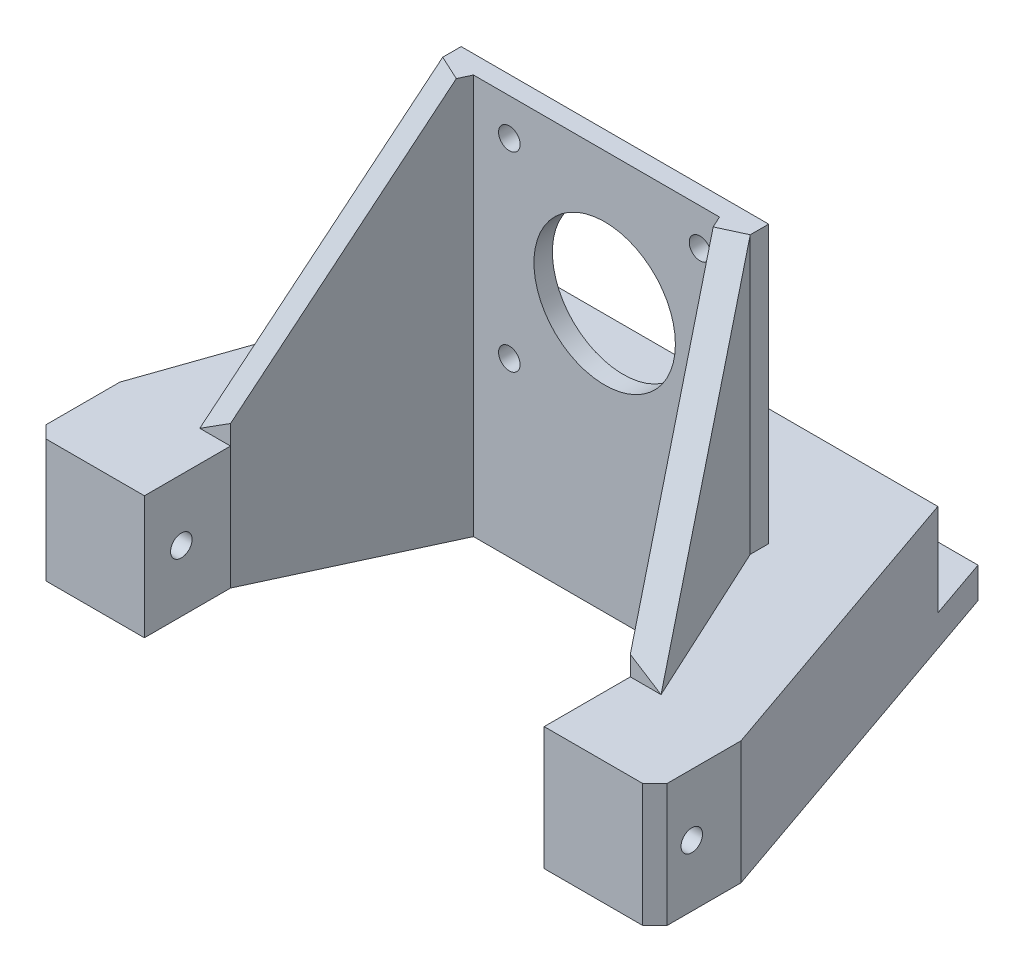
ISO-10303-21;
HEADER;
FILE_DESCRIPTION(('STEP AP214'),'2;1');
FILE_NAME('part.step','',(''),(''),'','','');
FILE_SCHEMA(('AUTOMOTIVE_DESIGN { 1 0 10303 214 1 1 1 1 }'));
ENDSEC;
DATA;
#1=APPLICATION_CONTEXT('core data for automotive mechanical design processes');
#2=APPLICATION_PROTOCOL_DEFINITION('international standard','automotive_design',2000,#1);
#3=PRODUCT_CONTEXT('',#1,'mechanical');
#4=PRODUCT('Part','Part','',(#3));
#5=PRODUCT_RELATED_PRODUCT_CATEGORY('part','',(#4));
#6=PRODUCT_DEFINITION_FORMATION('','',#4);
#7=PRODUCT_DEFINITION_CONTEXT('part definition',#1,'design');
#8=PRODUCT_DEFINITION('design','',#6,#7);
#9=PRODUCT_DEFINITION_SHAPE('','',#8);
#10=(LENGTH_UNIT() NAMED_UNIT(*) SI_UNIT(.MILLI.,.METRE.));
#11=(NAMED_UNIT(*) PLANE_ANGLE_UNIT() SI_UNIT($,.RADIAN.));
#12=(NAMED_UNIT(*) SI_UNIT($,.STERADIAN.) SOLID_ANGLE_UNIT());
#13=UNCERTAINTY_MEASURE_WITH_UNIT(LENGTH_MEASURE(1.E-05),#10,'distance_accuracy_value','');
#14=(GEOMETRIC_REPRESENTATION_CONTEXT(3) GLOBAL_UNCERTAINTY_ASSIGNED_CONTEXT((#13)) GLOBAL_UNIT_ASSIGNED_CONTEXT((#10,
#11,#12)) REPRESENTATION_CONTEXT('',''));
#15=CARTESIAN_POINT('',(0.,0.,0.));
#16=DIRECTION('',(0.,0.,1.));
#17=DIRECTION('',(1.,0.,0.));
#18=AXIS2_PLACEMENT_3D('',#15,#16,#17);
#19=CARTESIAN_POINT('',(0.,20.,-22.));
#20=DIRECTION('',(0.,0.,-1.));
#21=DIRECTION('',(-1.,0.,0.));
#22=AXIS2_PLACEMENT_3D('',#19,#20,#21);
#23=PLANE('',#22);
#24=DIRECTION('',(0.,-1.,0.));
#25=VECTOR('',#24,1.);
#26=CARTESIAN_POINT('',(33.5,20.,-22.));
#27=LINE('',#26,#25);
#28=CARTESIAN_POINT('',(33.5,20.,-22.));
#29=VERTEX_POINT('',#28);
#30=CARTESIAN_POINT('',(33.5,5.,-22.));
#31=VERTEX_POINT('',#30);
#32=EDGE_CURVE('E308',#29,#31,#27,.T.);
#33=ORIENTED_EDGE('',*,*,#32,.T.);
#34=DIRECTION('',(-1.,0.,0.));
#35=VECTOR('',#34,1.);
#36=CARTESIAN_POINT('',(33.5,5.,-22.));
#37=LINE('',#36,#35);
#38=CARTESIAN_POINT('',(-33.5,5.,-22.));
#39=VERTEX_POINT('',#38);
#40=EDGE_CURVE('E492',#31,#39,#37,.T.);
#41=ORIENTED_EDGE('',*,*,#40,.T.);
#42=DIRECTION('',(0.,-1.,0.));
#43=VECTOR('',#42,1.);
#44=CARTESIAN_POINT('',(-33.5,20.,-22.));
#45=LINE('',#44,#43);
#46=CARTESIAN_POINT('',(-33.5,20.,-22.));
#47=VERTEX_POINT('',#46);
#48=EDGE_CURVE('E283',#47,#39,#45,.T.);
#49=ORIENTED_EDGE('',*,*,#48,.F.);
#50=DIRECTION('',(1.,0.,0.));
#51=VECTOR('',#50,1.);
#52=CARTESIAN_POINT('',(0.,20.,-22.));
#53=LINE('',#52,#51);
#54=EDGE_CURVE('E298',#47,#29,#53,.T.);
#55=ORIENTED_EDGE('',*,*,#54,.T.);
#56=EDGE_LOOP('',(#33,#41,#49,#55));
#57=FACE_BOUND('',#56,.T.);
#58=ADVANCED_FACE('F37',(#57),#23,.T.);
#59=CARTESIAN_POINT('',(0.,20.,27.));
#60=DIRECTION('',(0.,0.,1.));
#61=DIRECTION('',(1.,0.,0.));
#62=AXIS2_PLACEMENT_3D('',#59,#60,#61);
#63=PLANE('',#62);
#64=DIRECTION('',(0.,-1.,0.));
#65=VECTOR('',#64,1.);
#66=CARTESIAN_POINT('',(32.5,20.,27.));
#67=LINE('',#66,#65);
#68=CARTESIAN_POINT('',(32.5,23.1770686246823,27.));
#69=VERTEX_POINT('',#68);
#70=CARTESIAN_POINT('',(32.5,20.,27.));
#71=VERTEX_POINT('',#70);
#72=EDGE_CURVE('E331',#69,#71,#67,.T.);
#73=ORIENTED_EDGE('',*,*,#72,.T.);
#74=DIRECTION('',(-1.,0.,0.));
#75=VECTOR('',#74,1.);
#76=CARTESIAN_POINT('',(50.5,20.,27.));
#77=LINE('',#76,#75);
#78=CARTESIAN_POINT('',(37.5,20.,27.));
#79=VERTEX_POINT('',#78);
#80=EDGE_CURVE('E387',#79,#71,#77,.T.);
#81=ORIENTED_EDGE('',*,*,#80,.F.);
#82=DIRECTION('',(0.844024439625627,-0.536304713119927,0.));
#83=VECTOR('',#82,1.);
#84=CARTESIAN_POINT('',(10.7858529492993,36.9745356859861,27.));
#85=LINE('',#84,#83);
#86=EDGE_CURVE('E232',#69,#79,#85,.T.);
#87=ORIENTED_EDGE('',*,*,#86,.F.);
#88=EDGE_LOOP('',(#73,#81,#87));
#89=FACE_BOUND('',#88,.T.);
#90=ADVANCED_FACE('F468',(#89),#63,.T.);
#91=CARTESIAN_POINT('',(0.,20.,27.));
#92=DIRECTION('',(0.,0.,-1.));
#93=DIRECTION('',(-1.,0.,0.));
#94=AXIS2_PLACEMENT_3D('',#91,#92,#93);
#95=PLANE('',#94);
#96=DIRECTION('',(-1.,0.,0.));
#97=VECTOR('',#96,1.);
#98=CARTESIAN_POINT('',(-50.5,20.,27.));
#99=LINE('',#98,#97);
#100=CARTESIAN_POINT('',(-32.5,20.,27.));
#101=VERTEX_POINT('',#100);
#102=CARTESIAN_POINT('',(-37.5,20.,27.));
#103=VERTEX_POINT('',#102);
#104=EDGE_CURVE('E402',#101,#103,#99,.T.);
#105=ORIENTED_EDGE('',*,*,#104,.F.);
#106=DIRECTION('',(0.,-1.,0.));
#107=VECTOR('',#106,1.);
#108=CARTESIAN_POINT('',(-32.5,20.,27.));
#109=LINE('',#108,#107);
#110=CARTESIAN_POINT('',(-32.5,23.1770686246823,27.));
#111=VERTEX_POINT('',#110);
#112=EDGE_CURVE('E339',#111,#101,#109,.T.);
#113=ORIENTED_EDGE('',*,*,#112,.F.);
#114=DIRECTION('',(-0.844024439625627,-0.536304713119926,0.));
#115=VECTOR('',#114,1.);
#116=CARTESIAN_POINT('',(-10.7858529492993,36.9745356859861,27.));
#117=LINE('',#116,#115);
#118=EDGE_CURVE('E224',#111,#103,#117,.T.);
#119=ORIENTED_EDGE('',*,*,#118,.T.);
#120=EDGE_LOOP('',(#105,#113,#119));
#121=FACE_BOUND('',#120,.T.);
#122=ADVANCED_FACE('F428',(#121),#95,.F.);
#123=CARTESIAN_POINT('',(0.,20.,0.));
#124=DIRECTION('',(0.,0.,-1.));
#125=DIRECTION('',(-1.,0.,0.));
#126=AXIS2_PLACEMENT_3D('',#123,#124,#125);
#127=PLANE('',#126);
#128=CARTESIAN_POINT('',(1.33089386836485,43.5,0.));
#129=DIRECTION('',(0.,0.,1.));
#130=DIRECTION('',(1.,0.,0.));
#131=AXIS2_PLACEMENT_3D('',#128,#129,#130);
#132=CIRCLE('',#131,11.5);
#133=CARTESIAN_POINT('',(12.8308938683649,43.5,0.));
#134=VERTEX_POINT('',#133);
#135=EDGE_CURVE('E246',#134,#134,#132,.T.);
#136=ORIENTED_EDGE('',*,*,#135,.F.);
#137=EDGE_LOOP('',(#136));
#138=FACE_BOUND('',#137,.T.);
#139=CARTESIAN_POINT('',(-14.1691061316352,28.,0.));
#140=DIRECTION('',(0.,0.,1.));
#141=DIRECTION('',(1.,0.,0.));
#142=AXIS2_PLACEMENT_3D('',#139,#140,#141);
#143=CIRCLE('',#142,1.75);
#144=CARTESIAN_POINT('',(-12.4191061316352,28.,0.));
#145=VERTEX_POINT('',#144);
#146=EDGE_CURVE('E255',#145,#145,#143,.T.);
#147=ORIENTED_EDGE('',*,*,#146,.F.);
#148=EDGE_LOOP('',(#147));
#149=FACE_BOUND('',#148,.T.);
#150=CARTESIAN_POINT('',(16.8308938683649,28.,0.));
#151=DIRECTION('',(0.,0.,1.));
#152=DIRECTION('',(1.,0.,0.));
#153=AXIS2_PLACEMENT_3D('',#150,#151,#152);
#154=CIRCLE('',#153,1.75);
#155=CARTESIAN_POINT('',(18.5808938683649,28.,0.));
#156=VERTEX_POINT('',#155);
#157=EDGE_CURVE('E252',#156,#156,#154,.T.);
#158=ORIENTED_EDGE('',*,*,#157,.F.);
#159=EDGE_LOOP('',(#158));
#160=FACE_BOUND('',#159,.T.);
#161=CARTESIAN_POINT('',(16.8308938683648,59.,0.));
#162=DIRECTION('',(0.,0.,1.));
#163=DIRECTION('',(1.,0.,0.));
#164=AXIS2_PLACEMENT_3D('',#161,#162,#163);
#165=CIRCLE('',#164,1.75);
#166=CARTESIAN_POINT('',(18.5808938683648,59.,0.));
#167=VERTEX_POINT('',#166);
#168=EDGE_CURVE('E248',#167,#167,#165,.T.);
#169=ORIENTED_EDGE('',*,*,#168,.F.);
#170=EDGE_LOOP('',(#169));
#171=FACE_BOUND('',#170,.T.);
#172=CARTESIAN_POINT('',(-14.1691061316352,59.,0.));
#173=DIRECTION('',(0.,0.,1.));
#174=DIRECTION('',(1.,0.,0.));
#175=AXIS2_PLACEMENT_3D('',#172,#173,#174);
#176=CIRCLE('',#175,1.75);
#177=CARTESIAN_POINT('',(-12.4191061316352,59.,0.));
#178=VERTEX_POINT('',#177);
#179=EDGE_CURVE('E251',#178,#178,#176,.T.);
#180=ORIENTED_EDGE('',*,*,#179,.F.);
#181=EDGE_LOOP('',(#180));
#182=FACE_BOUND('',#181,.T.);
#183=DIRECTION('',(1.,0.,0.));
#184=VECTOR('',#183,1.);
#185=CARTESIAN_POINT('',(25.,65.,0.));
#186=LINE('',#185,#184);
#187=CARTESIAN_POINT('',(-20.,65.,0.));
#188=VERTEX_POINT('',#187);
#189=CARTESIAN_POINT('',(20.,65.,0.));
#190=VERTEX_POINT('',#189);
#191=EDGE_CURVE('E276',#188,#190,#186,.T.);
#192=ORIENTED_EDGE('',*,*,#191,.F.);
#193=DIRECTION('',(0.,-1.,0.));
#194=VECTOR('',#193,1.);
#195=CARTESIAN_POINT('',(-20.,20.,0.));
#196=LINE('',#195,#194);
#197=CARTESIAN_POINT('',(-20.,0.,0.));
#198=VERTEX_POINT('',#197);
#199=EDGE_CURVE('E336',#188,#198,#196,.T.);
#200=ORIENTED_EDGE('',*,*,#199,.T.);
#201=DIRECTION('',(1.,0.,0.));
#202=VECTOR('',#201,1.);
#203=CARTESIAN_POINT('',(0.,0.,0.));
#204=LINE('',#203,#202);
#205=CARTESIAN_POINT('',(20.,0.,0.));
#206=VERTEX_POINT('',#205);
#207=EDGE_CURVE('E312',#198,#206,#204,.T.);
#208=ORIENTED_EDGE('',*,*,#207,.T.);
#209=DIRECTION('',(0.,-1.,0.));
#210=VECTOR('',#209,1.);
#211=CARTESIAN_POINT('',(20.,20.,0.));
#212=LINE('',#211,#210);
#213=EDGE_CURVE('E334',#190,#206,#212,.T.);
#214=ORIENTED_EDGE('',*,*,#213,.F.);
#215=EDGE_LOOP('',(#192,#200,#208,#214));
#216=FACE_BOUND('',#215,.T.);
#217=ADVANCED_FACE('F474',(#138,#149,#160,#171,#182,#216),#127,.F.);
#218=CARTESIAN_POINT('',(0.,20.,0.));
#219=DIRECTION('',(0.,1.,0.));
#220=DIRECTION('',(0.,0.,1.));
#221=AXIS2_PLACEMENT_3D('',#218,#219,#220);
#222=PLANE('',#221);
#223=DIRECTION('',(-0.707106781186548,0.,-0.707106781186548));
#224=VECTOR('',#223,1.);
#225=CARTESIAN_POINT('',(-44.75,20.,44.75));
#226=LINE('',#225,#224);
#227=CARTESIAN_POINT('',(-48.5,20.,41.));
#228=VERTEX_POINT('',#227);
#229=CARTESIAN_POINT('',(-50.5,20.,39.));
#230=VERTEX_POINT('',#229);
#231=EDGE_CURVE('E191',#228,#230,#226,.T.);
#232=ORIENTED_EDGE('',*,*,#231,.F.);
#233=DIRECTION('',(-1.,0.,0.));
#234=VECTOR('',#233,1.);
#235=CARTESIAN_POINT('',(-50.5,20.,41.));
#236=LINE('',#235,#234);
#237=CARTESIAN_POINT('',(-32.5,20.,41.));
#238=VERTEX_POINT('',#237);
#239=EDGE_CURVE('E404',#238,#228,#236,.T.);
#240=ORIENTED_EDGE('',*,*,#239,.F.);
#241=DIRECTION('',(0.,0.,-1.));
#242=VECTOR('',#241,1.);
#243=CARTESIAN_POINT('',(-32.5,20.,41.));
#244=LINE('',#243,#242);
#245=EDGE_CURVE('E216',#238,#101,#244,.T.);
#246=ORIENTED_EDGE('',*,*,#245,.T.);
#247=ORIENTED_EDGE('',*,*,#104,.T.);
#248=DIRECTION('',(-0.420123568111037,0.,0.907466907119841));
#249=VECTOR('',#248,1.);
#250=CARTESIAN_POINT('',(-25.,20.,0.));
#251=LINE('',#250,#249);
#252=CARTESIAN_POINT('',(-25.,20.,0.));
#253=VERTEX_POINT('',#252);
#254=EDGE_CURVE('E237',#253,#103,#251,.T.);
#255=ORIENTED_EDGE('',*,*,#254,.F.);
#256=DIRECTION('',(0.,0.,1.));
#257=VECTOR('',#256,1.);
#258=CARTESIAN_POINT('',(-25.,20.,0.));
#259=LINE('',#258,#257);
#260=CARTESIAN_POINT('',(-25.,20.,-2.99999999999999));
#261=VERTEX_POINT('',#260);
#262=EDGE_CURVE('E282',#261,#253,#259,.T.);
#263=ORIENTED_EDGE('',*,*,#262,.F.);
#264=DIRECTION('',(-1.,0.,0.));
#265=VECTOR('',#264,1.);
#266=CARTESIAN_POINT('',(25.,20.,-2.99999999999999));
#267=LINE('',#266,#265);
#268=CARTESIAN_POINT('',(25.,20.,-2.99999999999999));
#269=VERTEX_POINT('',#268);
#270=EDGE_CURVE('E280',#269,#261,#267,.T.);
#271=ORIENTED_EDGE('',*,*,#270,.F.);
#272=DIRECTION('',(0.,0.,-1.));
#273=VECTOR('',#272,1.);
#274=CARTESIAN_POINT('',(25.,20.,0.));
#275=LINE('',#274,#273);
#276=CARTESIAN_POINT('',(25.,20.,0.));
#277=VERTEX_POINT('',#276);
#278=EDGE_CURVE('E266',#277,#269,#275,.T.);
#279=ORIENTED_EDGE('',*,*,#278,.F.);
#280=DIRECTION('',(-0.420123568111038,0.,-0.907466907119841));
#281=VECTOR('',#280,1.);
#282=CARTESIAN_POINT('',(25.,20.,0.));
#283=LINE('',#282,#281);
#284=EDGE_CURVE('E240',#79,#277,#283,.T.);
#285=ORIENTED_EDGE('',*,*,#284,.F.);
#286=ORIENTED_EDGE('',*,*,#80,.T.);
#287=DIRECTION('',(0.,0.,-1.));
#288=VECTOR('',#287,1.);
#289=CARTESIAN_POINT('',(32.5,20.,41.));
#290=LINE('',#289,#288);
#291=CARTESIAN_POINT('',(32.5,20.,41.));
#292=VERTEX_POINT('',#291);
#293=EDGE_CURVE('E394',#292,#71,#290,.T.);
#294=ORIENTED_EDGE('',*,*,#293,.F.);
#295=DIRECTION('',(-1.,0.,0.));
#296=VECTOR('',#295,1.);
#297=CARTESIAN_POINT('',(50.5,20.,41.));
#298=LINE('',#297,#296);
#299=CARTESIAN_POINT('',(48.5,20.,41.));
#300=VERTEX_POINT('',#299);
#301=EDGE_CURVE('E383',#300,#292,#298,.T.);
#302=ORIENTED_EDGE('',*,*,#301,.F.);
#303=DIRECTION('',(-0.707106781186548,0.,0.707106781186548));
#304=VECTOR('',#303,1.);
#305=CARTESIAN_POINT('',(44.75,20.,44.75));
#306=LINE('',#305,#304);
#307=CARTESIAN_POINT('',(50.5,20.,39.));
#308=VERTEX_POINT('',#307);
#309=EDGE_CURVE('E58',#308,#300,#306,.T.);
#310=ORIENTED_EDGE('',*,*,#309,.F.);
#311=DIRECTION('',(0.,0.,-1.));
#312=VECTOR('',#311,1.);
#313=CARTESIAN_POINT('',(50.5,20.,41.));
#314=LINE('',#313,#312);
#315=CARTESIAN_POINT('',(50.5,20.,27.));
#316=VERTEX_POINT('',#315);
#317=EDGE_CURVE('E397',#308,#316,#314,.T.);
#318=ORIENTED_EDGE('',*,*,#317,.T.);
#319=DIRECTION('',(0.327772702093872,0.,0.944756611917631));
#320=VECTOR('',#319,1.);
#321=CARTESIAN_POINT('',(36.7135687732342,20.,-12.7373605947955));
#322=LINE('',#321,#320);
#323=EDGE_CURVE('E305',#29,#316,#322,.T.);
#324=ORIENTED_EDGE('',*,*,#323,.F.);
#325=ORIENTED_EDGE('',*,*,#54,.F.);
#326=DIRECTION('',(-0.327772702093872,0.,0.944756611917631));
#327=VECTOR('',#326,1.);
#328=CARTESIAN_POINT('',(-36.7135687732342,20.,-12.7373605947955));
#329=LINE('',#328,#327);
#330=CARTESIAN_POINT('',(-50.5,20.,27.));
#331=VERTEX_POINT('',#330);
#332=EDGE_CURVE('E301',#47,#331,#329,.T.);
#333=ORIENTED_EDGE('',*,*,#332,.T.);
#334=DIRECTION('',(0.,0.,-1.));
#335=VECTOR('',#334,1.);
#336=CARTESIAN_POINT('',(-50.5,20.,41.));
#337=LINE('',#336,#335);
#338=EDGE_CURVE('E407',#230,#331,#337,.T.);
#339=ORIENTED_EDGE('',*,*,#338,.F.);
#340=EDGE_LOOP('',(#232,#240,#246,#247,#255,#263,#271,#279,#285,#286,#294,#302,#310,#318,#324,
#325,#333,#339));
#341=FACE_BOUND('',#340,.T.);
#342=ADVANCED_FACE('F416',(#341),#222,.T.);
#343=CARTESIAN_POINT('',(25.,20.,-10.));
#344=DIRECTION('',(0.,-1.,0.));
#345=DIRECTION('',(0.,0.,-1.));
#346=AXIS2_PLACEMENT_3D('',#343,#344,#345);
#347=CYLINDRICAL_SURFACE('',#346,8.05);
#348=CARTESIAN_POINT('',(25.,0.,-10.));
#349=DIRECTION('',(0.,1.,0.));
#350=DIRECTION('',(0.,0.,1.));
#351=AXIS2_PLACEMENT_3D('',#348,#349,#350);
#352=CIRCLE('',#351,8.05);
#353=CARTESIAN_POINT('',(25.,0.,-1.95));
#354=VERTEX_POINT('',#353);
#355=EDGE_CURVE('E321',#354,#354,#352,.T.);
#356=ORIENTED_EDGE('',*,*,#355,.F.);
#357=EDGE_LOOP('',(#356));
#358=FACE_BOUND('',#357,.T.);
#359=CARTESIAN_POINT('',(25.,19.,-10.));
#360=DIRECTION('',(0.,1.,0.));
#361=DIRECTION('',(0.,0.,1.));
#362=AXIS2_PLACEMENT_3D('',#359,#360,#361);
#363=CIRCLE('',#362,8.05);
#364=CARTESIAN_POINT('',(25.,19.,-1.95));
#365=VERTEX_POINT('',#364);
#366=EDGE_CURVE('E263',#365,#365,#363,.T.);
#367=ORIENTED_EDGE('',*,*,#366,.T.);
#368=EDGE_LOOP('',(#367));
#369=FACE_BOUND('',#368,.T.);
#370=ADVANCED_FACE('F661',(#358,#369),#347,.F.);
#371=CARTESIAN_POINT('',(-25.,20.,-10.));
#372=DIRECTION('',(0.,-1.,0.));
#373=DIRECTION('',(0.,0.,-1.));
#374=AXIS2_PLACEMENT_3D('',#371,#372,#373);
#375=CYLINDRICAL_SURFACE('',#374,8.05);
#376=CARTESIAN_POINT('',(-25.,0.,-10.));
#377=DIRECTION('',(0.,1.,0.));
#378=DIRECTION('',(0.,0.,1.));
#379=AXIS2_PLACEMENT_3D('',#376,#377,#378);
#380=CIRCLE('',#379,8.05);
#381=CARTESIAN_POINT('',(-25.,0.,-1.95));
#382=VERTEX_POINT('',#381);
#383=EDGE_CURVE('E302',#382,#382,#380,.F.);
#384=ORIENTED_EDGE('',*,*,#383,.T.);
#385=EDGE_LOOP('',(#384));
#386=FACE_BOUND('',#385,.T.);
#387=CARTESIAN_POINT('',(-25.,19.,-10.));
#388=DIRECTION('',(0.,1.,0.));
#389=DIRECTION('',(0.,0.,1.));
#390=AXIS2_PLACEMENT_3D('',#387,#388,#389);
#391=CIRCLE('',#390,8.05);
#392=CARTESIAN_POINT('',(-25.,19.,-1.95));
#393=VERTEX_POINT('',#392);
#394=EDGE_CURVE('E286',#393,#393,#391,.F.);
#395=ORIENTED_EDGE('',*,*,#394,.F.);
#396=EDGE_LOOP('',(#395));
#397=FACE_BOUND('',#396,.T.);
#398=ADVANCED_FACE('F709',(#386,#397),#375,.F.);
#399=CARTESIAN_POINT('',(-36.7135687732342,20.,-12.7373605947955));
#400=DIRECTION('',(0.944756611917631,0.,0.327772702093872));
#401=DIRECTION('',(0.327772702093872,0.,-0.944756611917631));
#402=AXIS2_PLACEMENT_3D('',#399,#400,#401);
#403=PLANE('',#402);
#404=DIRECTION('',(-0.327772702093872,0.,0.944756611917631));
#405=VECTOR('',#404,1.);
#406=CARTESIAN_POINT('',(-36.7135687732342,0.,-12.7373605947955));
#407=LINE('',#406,#405);
#408=CARTESIAN_POINT('',(-30.030612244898,0.,-32.));
#409=VERTEX_POINT('',#408);
#410=CARTESIAN_POINT('',(-50.5,0.,27.));
#411=VERTEX_POINT('',#410);
#412=EDGE_CURVE('E297',#409,#411,#407,.T.);
#413=ORIENTED_EDGE('',*,*,#412,.T.);
#414=DIRECTION('',(0.,-1.,0.));
#415=VECTOR('',#414,1.);
#416=CARTESIAN_POINT('',(-50.5,20.,27.));
#417=LINE('',#416,#415);
#418=EDGE_CURVE('E209',#331,#411,#417,.T.);
#419=ORIENTED_EDGE('',*,*,#418,.F.);
#420=ORIENTED_EDGE('',*,*,#332,.F.);
#421=ORIENTED_EDGE('',*,*,#48,.T.);
#422=DIRECTION('',(0.327772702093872,0.,-0.944756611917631));
#423=VECTOR('',#422,1.);
#424=CARTESIAN_POINT('',(-33.5,5.,-22.));
#425=LINE('',#424,#423);
#426=CARTESIAN_POINT('',(-30.030612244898,5.,-32.));
#427=VERTEX_POINT('',#426);
#428=EDGE_CURVE('E510',#39,#427,#425,.T.);
#429=ORIENTED_EDGE('',*,*,#428,.T.);
#430=DIRECTION('',(0.,-1.,0.));
#431=VECTOR('',#430,1.);
#432=CARTESIAN_POINT('',(-30.030612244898,5.,-32.));
#433=LINE('',#432,#431);
#434=EDGE_CURVE('E505',#427,#409,#433,.T.);
#435=ORIENTED_EDGE('',*,*,#434,.T.);
#436=EDGE_LOOP('',(#413,#419,#420,#421,#429,#435));
#437=FACE_BOUND('',#436,.T.);
#438=ADVANCED_FACE('F535',(#437),#403,.F.);
#439=CARTESIAN_POINT('',(-16.469923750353,20.,-7.6249646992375));
#440=DIRECTION('',(-0.907466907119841,0.,-0.420123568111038));
#441=DIRECTION('',(-0.420123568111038,0.,0.907466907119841));
#442=AXIS2_PLACEMENT_3D('',#439,#440,#441);
#443=PLANE('',#442);
#444=DIRECTION('',(0.420123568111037,0.,-0.907466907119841));
#445=VECTOR('',#444,1.);
#446=CARTESIAN_POINT('',(-32.5,65.,27.));
#447=LINE('',#446,#445);
#448=CARTESIAN_POINT('',(-20.8825190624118,65.,1.90624117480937));
#449=VERTEX_POINT('',#448);
#450=EDGE_CURVE('E238',#449,#188,#447,.T.);
#451=ORIENTED_EDGE('',*,*,#450,.F.);
#452=DIRECTION('',(-0.231710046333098,-0.834156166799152,0.500493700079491));
#453=VECTOR('',#452,1.);
#454=CARTESIAN_POINT('',(-28.2379868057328,38.5203161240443,17.7940515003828));
#455=LINE('',#454,#453);
#456=EDGE_CURVE('E221',#449,#111,#455,.T.);
#457=ORIENTED_EDGE('',*,*,#456,.T.);
#458=ORIENTED_EDGE('',*,*,#112,.T.);
#459=DIRECTION('',(0.,1.,0.));
#460=VECTOR('',#459,1.);
#461=CARTESIAN_POINT('',(-32.5,20.,27.));
#462=LINE('',#461,#460);
#463=CARTESIAN_POINT('',(-32.5,0.,27.));
#464=VERTEX_POINT('',#463);
#465=EDGE_CURVE('E399',#464,#101,#462,.T.);
#466=ORIENTED_EDGE('',*,*,#465,.F.);
#467=DIRECTION('',(0.420123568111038,0.,-0.907466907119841));
#468=VECTOR('',#467,1.);
#469=CARTESIAN_POINT('',(-16.469923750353,0.,-7.6249646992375));
#470=LINE('',#469,#468);
#471=EDGE_CURVE('E310',#464,#198,#470,.T.);
#472=ORIENTED_EDGE('',*,*,#471,.T.);
#473=ORIENTED_EDGE('',*,*,#199,.F.);
#474=EDGE_LOOP('',(#451,#457,#458,#466,#472,#473));
#475=FACE_BOUND('',#474,.T.);
#476=ADVANCED_FACE('F424',(#475),#443,.F.);
#477=CARTESIAN_POINT('',(16.469923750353,20.,-7.6249646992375));
#478=DIRECTION('',(-0.907466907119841,0.,0.420123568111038));
#479=DIRECTION('',(0.420123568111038,0.,0.907466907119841));
#480=AXIS2_PLACEMENT_3D('',#477,#478,#479);
#481=PLANE('',#480);
#482=DIRECTION('',(0.231710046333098,-0.834156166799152,0.500493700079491));
#483=VECTOR('',#482,1.);
#484=CARTESIAN_POINT('',(28.2379868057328,38.5203161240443,17.7940515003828));
#485=LINE('',#484,#483);
#486=CARTESIAN_POINT('',(20.8825190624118,65.,1.90624117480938));
#487=VERTEX_POINT('',#486);
#488=EDGE_CURVE('E235',#487,#69,#485,.T.);
#489=ORIENTED_EDGE('',*,*,#488,.F.);
#490=DIRECTION('',(0.420123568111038,0.,0.907466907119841));
#491=VECTOR('',#490,1.);
#492=CARTESIAN_POINT('',(32.5,65.,27.));
#493=LINE('',#492,#491);
#494=EDGE_CURVE('E243',#190,#487,#493,.T.);
#495=ORIENTED_EDGE('',*,*,#494,.F.);
#496=ORIENTED_EDGE('',*,*,#213,.T.);
#497=DIRECTION('',(-0.420123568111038,0.,-0.907466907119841));
#498=VECTOR('',#497,1.);
#499=CARTESIAN_POINT('',(16.469923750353,0.,-7.6249646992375));
#500=LINE('',#499,#498);
#501=CARTESIAN_POINT('',(32.5,0.,27.));
#502=VERTEX_POINT('',#501);
#503=EDGE_CURVE('E315',#502,#206,#500,.T.);
#504=ORIENTED_EDGE('',*,*,#503,.F.);
#505=DIRECTION('',(0.,-1.,0.));
#506=VECTOR('',#505,1.);
#507=CARTESIAN_POINT('',(32.5,0.,27.));
#508=LINE('',#507,#506);
#509=EDGE_CURVE('E389',#71,#502,#508,.T.);
#510=ORIENTED_EDGE('',*,*,#509,.F.);
#511=ORIENTED_EDGE('',*,*,#72,.F.);
#512=EDGE_LOOP('',(#489,#495,#496,#504,#510,#511));
#513=FACE_BOUND('',#512,.T.);
#514=ADVANCED_FACE('F463',(#513),#481,.T.);
#515=CARTESIAN_POINT('',(36.7135687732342,20.,-12.7373605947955));
#516=DIRECTION('',(0.944756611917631,0.,-0.327772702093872));
#517=DIRECTION('',(-0.327772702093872,0.,-0.944756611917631));
#518=AXIS2_PLACEMENT_3D('',#515,#516,#517);
#519=PLANE('',#518);
#520=DIRECTION('',(0.327772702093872,0.,0.944756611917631));
#521=VECTOR('',#520,1.);
#522=CARTESIAN_POINT('',(36.7135687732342,0.,-12.7373605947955));
#523=LINE('',#522,#521);
#524=CARTESIAN_POINT('',(30.030612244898,0.,-32.));
#525=VERTEX_POINT('',#524);
#526=CARTESIAN_POINT('',(50.5,0.,27.));
#527=VERTEX_POINT('',#526);
#528=EDGE_CURVE('E318',#525,#527,#523,.T.);
#529=ORIENTED_EDGE('',*,*,#528,.F.);
#530=DIRECTION('',(0.,-1.,0.));
#531=VECTOR('',#530,1.);
#532=CARTESIAN_POINT('',(30.030612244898,5.,-32.));
#533=LINE('',#532,#531);
#534=CARTESIAN_POINT('',(30.030612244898,5.,-32.));
#535=VERTEX_POINT('',#534);
#536=EDGE_CURVE('E501',#535,#525,#533,.T.);
#537=ORIENTED_EDGE('',*,*,#536,.F.);
#538=DIRECTION('',(0.327772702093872,0.,0.944756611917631));
#539=VECTOR('',#538,1.);
#540=CARTESIAN_POINT('',(30.030612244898,5.,-32.));
#541=LINE('',#540,#539);
#542=EDGE_CURVE('E499',#535,#31,#541,.T.);
#543=ORIENTED_EDGE('',*,*,#542,.T.);
#544=ORIENTED_EDGE('',*,*,#32,.F.);
#545=ORIENTED_EDGE('',*,*,#323,.T.);
#546=DIRECTION('',(0.,-1.,0.));
#547=VECTOR('',#546,1.);
#548=CARTESIAN_POINT('',(50.5,20.,27.));
#549=LINE('',#548,#547);
#550=EDGE_CURVE('E328',#316,#527,#549,.T.);
#551=ORIENTED_EDGE('',*,*,#550,.T.);
#552=EDGE_LOOP('',(#529,#537,#543,#544,#545,#551));
#553=FACE_BOUND('',#552,.T.);
#554=ADVANCED_FACE('F497',(#553),#519,.T.);
#555=CARTESIAN_POINT('',(0.,0.,0.));
#556=DIRECTION('',(0.,1.,0.));
#557=DIRECTION('',(0.,0.,1.));
#558=AXIS2_PLACEMENT_3D('',#555,#556,#557);
#559=PLANE('',#558);
#560=CARTESIAN_POINT('',(-16.6,0.,-26.5));
#561=DIRECTION('',(0.,-1.,0.));
#562=DIRECTION('',(0.,0.,-1.));
#563=AXIS2_PLACEMENT_3D('',#560,#561,#562);
#564=CIRCLE('',#563,1.4);
#565=CARTESIAN_POINT('',(-16.6,0.,-27.9));
#566=VERTEX_POINT('',#565);
#567=EDGE_CURVE('E545',#566,#566,#564,.T.);
#568=ORIENTED_EDGE('',*,*,#567,.F.);
#569=EDGE_LOOP('',(#568));
#570=FACE_BOUND('',#569,.T.);
#571=CARTESIAN_POINT('',(10.9,0.,-26.5));
#572=DIRECTION('',(0.,-1.,0.));
#573=DIRECTION('',(0.,0.,-1.));
#574=AXIS2_PLACEMENT_3D('',#571,#572,#573);
#575=CIRCLE('',#574,1.4);
#576=CARTESIAN_POINT('',(10.9,0.,-27.9));
#577=VERTEX_POINT('',#576);
#578=EDGE_CURVE('E539',#577,#577,#575,.T.);
#579=ORIENTED_EDGE('',*,*,#578,.F.);
#580=EDGE_LOOP('',(#579));
#581=FACE_BOUND('',#580,.T.);
#582=DIRECTION('',(1.,0.,0.));
#583=VECTOR('',#582,1.);
#584=CARTESIAN_POINT('',(-50.5,0.,41.));
#585=LINE('',#584,#583);
#586=CARTESIAN_POINT('',(-48.5,0.,41.));
#587=VERTEX_POINT('',#586);
#588=CARTESIAN_POINT('',(-32.5,0.,41.));
#589=VERTEX_POINT('',#588);
#590=EDGE_CURVE('E203',#587,#589,#585,.T.);
#591=ORIENTED_EDGE('',*,*,#590,.F.);
#592=DIRECTION('',(0.707106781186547,0.,0.707106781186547));
#593=VECTOR('',#592,1.);
#594=CARTESIAN_POINT('',(-50.5,0.,39.));
#595=LINE('',#594,#593);
#596=CARTESIAN_POINT('',(-50.5,0.,39.));
#597=VERTEX_POINT('',#596);
#598=EDGE_CURVE('E50',#597,#587,#595,.T.);
#599=ORIENTED_EDGE('',*,*,#598,.F.);
#600=DIRECTION('',(0.,0.,-1.));
#601=VECTOR('',#600,1.);
#602=CARTESIAN_POINT('',(-50.5,0.,41.));
#603=LINE('',#602,#601);
#604=EDGE_CURVE('E200',#597,#411,#603,.T.);
#605=ORIENTED_EDGE('',*,*,#604,.T.);
#606=ORIENTED_EDGE('',*,*,#412,.F.);
#607=DIRECTION('',(1.,0.,0.));
#608=VECTOR('',#607,1.);
#609=CARTESIAN_POINT('',(-30.030612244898,0.,-32.));
#610=LINE('',#609,#608);
#611=EDGE_CURVE('E514',#409,#525,#610,.T.);
#612=ORIENTED_EDGE('',*,*,#611,.T.);
#613=ORIENTED_EDGE('',*,*,#528,.T.);
#614=DIRECTION('',(0.,0.,-1.));
#615=VECTOR('',#614,1.);
#616=CARTESIAN_POINT('',(50.5,0.,41.));
#617=LINE('',#616,#615);
#618=CARTESIAN_POINT('',(50.5,0.,39.));
#619=VERTEX_POINT('',#618);
#620=EDGE_CURVE('E374',#619,#527,#617,.T.);
#621=ORIENTED_EDGE('',*,*,#620,.F.);
#622=DIRECTION('',(0.707106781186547,0.,-0.707106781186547));
#623=VECTOR('',#622,1.);
#624=CARTESIAN_POINT('',(50.5,0.,39.));
#625=LINE('',#624,#623);
#626=CARTESIAN_POINT('',(48.5,0.,41.));
#627=VERTEX_POINT('',#626);
#628=EDGE_CURVE('E366',#627,#619,#625,.T.);
#629=ORIENTED_EDGE('',*,*,#628,.F.);
#630=DIRECTION('',(1.,0.,0.));
#631=VECTOR('',#630,1.);
#632=CARTESIAN_POINT('',(50.5,0.,41.));
#633=LINE('',#632,#631);
#634=CARTESIAN_POINT('',(32.5,0.,41.));
#635=VERTEX_POINT('',#634);
#636=EDGE_CURVE('E373',#635,#627,#633,.T.);
#637=ORIENTED_EDGE('',*,*,#636,.F.);
#638=DIRECTION('',(0.,0.,-1.));
#639=VECTOR('',#638,1.);
#640=CARTESIAN_POINT('',(32.5,0.,41.));
#641=LINE('',#640,#639);
#642=EDGE_CURVE('E381',#635,#502,#641,.T.);
#643=ORIENTED_EDGE('',*,*,#642,.T.);
#644=ORIENTED_EDGE('',*,*,#503,.T.);
#645=ORIENTED_EDGE('',*,*,#207,.F.);
#646=ORIENTED_EDGE('',*,*,#471,.F.);
#647=DIRECTION('',(0.,0.,-1.));
#648=VECTOR('',#647,1.);
#649=CARTESIAN_POINT('',(-32.5,0.,41.));
#650=LINE('',#649,#648);
#651=EDGE_CURVE('E211',#589,#464,#650,.T.);
#652=ORIENTED_EDGE('',*,*,#651,.F.);
#653=EDGE_LOOP('',(#591,#599,#605,#606,#612,#613,#621,#629,#637,#643,#644,#645,#646,#652));
#654=FACE_BOUND('',#653,.T.);
#655=ORIENTED_EDGE('',*,*,#355,.T.);
#656=EDGE_LOOP('',(#655));
#657=FACE_BOUND('',#656,.T.);
#658=ORIENTED_EDGE('',*,*,#383,.F.);
#659=EDGE_LOOP('',(#658));
#660=FACE_BOUND('',#659,.T.);
#661=ADVANCED_FACE('F198',(#570,#581,#654,#657,#660),#559,.F.);
#662=CARTESIAN_POINT('',(25.,65.,0.));
#663=DIRECTION('',(-1.,0.,0.));
#664=DIRECTION('',(0.,0.,1.));
#665=AXIS2_PLACEMENT_3D('',#662,#663,#664);
#666=PLANE('',#665);
#667=ORIENTED_EDGE('',*,*,#278,.T.);
#668=DIRECTION('',(0.,-1.,0.));
#669=VECTOR('',#668,1.);
#670=CARTESIAN_POINT('',(25.,65.,-2.99999999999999));
#671=LINE('',#670,#669);
#672=CARTESIAN_POINT('',(25.,65.,-2.99999999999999));
#673=VERTEX_POINT('',#672);
#674=EDGE_CURVE('E294',#673,#269,#671,.T.);
#675=ORIENTED_EDGE('',*,*,#674,.F.);
#676=DIRECTION('',(0.,0.,-1.));
#677=VECTOR('',#676,1.);
#678=CARTESIAN_POINT('',(25.,65.,0.));
#679=LINE('',#678,#677);
#680=CARTESIAN_POINT('',(25.,65.,0.));
#681=VERTEX_POINT('',#680);
#682=EDGE_CURVE('E268',#681,#673,#679,.T.);
#683=ORIENTED_EDGE('',*,*,#682,.F.);
#684=DIRECTION('',(0.,-1.,0.));
#685=VECTOR('',#684,1.);
#686=CARTESIAN_POINT('',(25.,65.,0.));
#687=LINE('',#686,#685);
#688=EDGE_CURVE('E278',#681,#277,#687,.T.);
#689=ORIENTED_EDGE('',*,*,#688,.T.);
#690=EDGE_LOOP('',(#667,#675,#683,#689));
#691=FACE_BOUND('',#690,.T.);
#692=ADVANCED_FACE('F448',(#691),#666,.F.);
#693=CARTESIAN_POINT('',(25.,65.,-2.99999999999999));
#694=DIRECTION('',(0.,0.,1.));
#695=DIRECTION('',(1.,0.,0.));
#696=AXIS2_PLACEMENT_3D('',#693,#694,#695);
#697=PLANE('',#696);
#698=CARTESIAN_POINT('',(1.33089386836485,43.5,-2.99999999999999));
#699=DIRECTION('',(0.,0.,1.));
#700=DIRECTION('',(1.,0.,0.));
#701=AXIS2_PLACEMENT_3D('',#698,#699,#700);
#702=CIRCLE('',#701,11.5);
#703=CARTESIAN_POINT('',(12.8308938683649,43.5,-2.99999999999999));
#704=VERTEX_POINT('',#703);
#705=EDGE_CURVE('E267',#704,#704,#702,.T.);
#706=ORIENTED_EDGE('',*,*,#705,.T.);
#707=EDGE_LOOP('',(#706));
#708=FACE_BOUND('',#707,.T.);
#709=CARTESIAN_POINT('',(-14.1691061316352,28.,-2.99999999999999));
#710=DIRECTION('',(0.,0.,1.));
#711=DIRECTION('',(1.,0.,0.));
#712=AXIS2_PLACEMENT_3D('',#709,#710,#711);
#713=CIRCLE('',#712,1.75);
#714=CARTESIAN_POINT('',(-12.4191061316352,28.,-2.99999999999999));
#715=VERTEX_POINT('',#714);
#716=EDGE_CURVE('E355',#715,#715,#713,.T.);
#717=ORIENTED_EDGE('',*,*,#716,.T.);
#718=EDGE_LOOP('',(#717));
#719=FACE_BOUND('',#718,.T.);
#720=CARTESIAN_POINT('',(16.8308938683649,28.,-2.99999999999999));
#721=DIRECTION('',(0.,0.,1.));
#722=DIRECTION('',(1.,0.,0.));
#723=AXIS2_PLACEMENT_3D('',#720,#721,#722);
#724=CIRCLE('',#723,1.75);
#725=CARTESIAN_POINT('',(18.5808938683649,28.,-2.99999999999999));
#726=VERTEX_POINT('',#725);
#727=EDGE_CURVE('E352',#726,#726,#724,.T.);
#728=ORIENTED_EDGE('',*,*,#727,.T.);
#729=EDGE_LOOP('',(#728));
#730=FACE_BOUND('',#729,.T.);
#731=CARTESIAN_POINT('',(16.8308938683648,59.,-2.99999999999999));
#732=DIRECTION('',(0.,0.,1.));
#733=DIRECTION('',(1.,0.,0.));
#734=AXIS2_PLACEMENT_3D('',#731,#732,#733);
#735=CIRCLE('',#734,1.75);
#736=CARTESIAN_POINT('',(18.5808938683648,59.,-2.99999999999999));
#737=VERTEX_POINT('',#736);
#738=EDGE_CURVE('E349',#737,#737,#735,.T.);
#739=ORIENTED_EDGE('',*,*,#738,.T.);
#740=EDGE_LOOP('',(#739));
#741=FACE_BOUND('',#740,.T.);
#742=CARTESIAN_POINT('',(-14.1691061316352,59.,-2.99999999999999));
#743=DIRECTION('',(0.,0.,1.));
#744=DIRECTION('',(1.,0.,0.));
#745=AXIS2_PLACEMENT_3D('',#742,#743,#744);
#746=CIRCLE('',#745,1.75);
#747=CARTESIAN_POINT('',(-12.4191061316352,59.,-2.99999999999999));
#748=VERTEX_POINT('',#747);
#749=EDGE_CURVE('E262',#748,#748,#746,.T.);
#750=ORIENTED_EDGE('',*,*,#749,.T.);
#751=EDGE_LOOP('',(#750));
#752=FACE_BOUND('',#751,.T.);
#753=ORIENTED_EDGE('',*,*,#674,.T.);
#754=ORIENTED_EDGE('',*,*,#270,.T.);
#755=DIRECTION('',(0.,-1.,0.));
#756=VECTOR('',#755,1.);
#757=CARTESIAN_POINT('',(-25.,65.,-2.99999999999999));
#758=LINE('',#757,#756);
#759=CARTESIAN_POINT('',(-25.,65.,-2.99999999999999));
#760=VERTEX_POINT('',#759);
#761=EDGE_CURVE('E291',#760,#261,#758,.T.);
#762=ORIENTED_EDGE('',*,*,#761,.F.);
#763=DIRECTION('',(-1.,0.,0.));
#764=VECTOR('',#763,1.);
#765=CARTESIAN_POINT('',(25.,65.,-2.99999999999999));
#766=LINE('',#765,#764);
#767=EDGE_CURVE('E271',#673,#760,#766,.T.);
#768=ORIENTED_EDGE('',*,*,#767,.F.);
#769=EDGE_LOOP('',(#753,#754,#762,#768));
#770=FACE_BOUND('',#769,.T.);
#771=ADVANCED_FACE('F441',(#708,#719,#730,#741,#752,#770),#697,.F.);
#772=CARTESIAN_POINT('',(-25.,65.,0.));
#773=DIRECTION('',(1.,0.,0.));
#774=DIRECTION('',(0.,0.,-1.));
#775=AXIS2_PLACEMENT_3D('',#772,#773,#774);
#776=PLANE('',#775);
#777=ORIENTED_EDGE('',*,*,#761,.T.);
#778=ORIENTED_EDGE('',*,*,#262,.T.);
#779=DIRECTION('',(0.,-1.,0.));
#780=VECTOR('',#779,1.);
#781=CARTESIAN_POINT('',(-25.,65.,0.));
#782=LINE('',#781,#780);
#783=CARTESIAN_POINT('',(-25.,65.,0.));
#784=VERTEX_POINT('',#783);
#785=EDGE_CURVE('E289',#784,#253,#782,.T.);
#786=ORIENTED_EDGE('',*,*,#785,.F.);
#787=DIRECTION('',(0.,0.,1.));
#788=VECTOR('',#787,1.);
#789=CARTESIAN_POINT('',(-25.,65.,0.));
#790=LINE('',#789,#788);
#791=EDGE_CURVE('E273',#760,#784,#790,.T.);
#792=ORIENTED_EDGE('',*,*,#791,.F.);
#793=EDGE_LOOP('',(#777,#778,#786,#792));
#794=FACE_BOUND('',#793,.T.);
#795=ADVANCED_FACE('F437',(#794),#776,.F.);
#796=CARTESIAN_POINT('',(0.,65.,0.));
#797=DIRECTION('',(0.,1.,0.));
#798=DIRECTION('',(0.,0.,1.));
#799=AXIS2_PLACEMENT_3D('',#796,#797,#798);
#800=PLANE('',#799);
#801=DIRECTION('',(-0.907466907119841,0.,-0.420123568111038));
#802=VECTOR('',#801,1.);
#803=CARTESIAN_POINT('',(15.8360108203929,65.,18.9055605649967));
#804=LINE('',#803,#802);
#805=EDGE_CURVE('E213',#449,#784,#804,.T.);
#806=ORIENTED_EDGE('',*,*,#805,.F.);
#807=ORIENTED_EDGE('',*,*,#450,.T.);
#808=ORIENTED_EDGE('',*,*,#191,.T.);
#809=ORIENTED_EDGE('',*,*,#494,.T.);
#810=DIRECTION('',(0.907466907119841,0.,-0.420123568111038));
#811=VECTOR('',#810,1.);
#812=CARTESIAN_POINT('',(-15.8360108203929,65.,18.9055605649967));
#813=LINE('',#812,#811);
#814=EDGE_CURVE('E229',#487,#681,#813,.T.);
#815=ORIENTED_EDGE('',*,*,#814,.T.);
#816=ORIENTED_EDGE('',*,*,#682,.T.);
#817=ORIENTED_EDGE('',*,*,#767,.T.);
#818=ORIENTED_EDGE('',*,*,#791,.T.);
#819=EDGE_LOOP('',(#806,#807,#808,#809,#815,#816,#817,#818));
#820=FACE_BOUND('',#819,.T.);
#821=ADVANCED_FACE('F458',(#820),#800,.T.);
#822=CARTESIAN_POINT('',(-25.,19.,-10.));
#823=DIRECTION('',(0.,1.,0.));
#824=DIRECTION('',(0.,0.,1.));
#825=AXIS2_PLACEMENT_3D('',#822,#823,#824);
#826=PLANE('',#825);
#827=ORIENTED_EDGE('',*,*,#394,.T.);
#828=EDGE_LOOP('',(#827));
#829=FACE_BOUND('',#828,.T.);
#830=ADVANCED_FACE('F759',(#829),#826,.F.);
#831=CARTESIAN_POINT('',(25.,19.,-10.));
#832=DIRECTION('',(0.,1.,0.));
#833=DIRECTION('',(0.,0.,1.));
#834=AXIS2_PLACEMENT_3D('',#831,#832,#833);
#835=PLANE('',#834);
#836=ORIENTED_EDGE('',*,*,#366,.F.);
#837=EDGE_LOOP('',(#836));
#838=FACE_BOUND('',#837,.T.);
#839=ADVANCED_FACE('F764',(#838),#835,.F.);
#840=CARTESIAN_POINT('',(-14.1691061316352,59.,-10.));
#841=DIRECTION('',(0.,0.,1.));
#842=DIRECTION('',(1.,0.,0.));
#843=AXIS2_PLACEMENT_3D('',#840,#841,#842);
#844=CYLINDRICAL_SURFACE('',#843,1.75);
#845=ORIENTED_EDGE('',*,*,#179,.T.);
#846=EDGE_LOOP('',(#845));
#847=FACE_BOUND('',#846,.T.);
#848=ORIENTED_EDGE('',*,*,#749,.F.);
#849=EDGE_LOOP('',(#848));
#850=FACE_BOUND('',#849,.T.);
#851=ADVANCED_FACE('F773',(#847,#850),#844,.F.);
#852=CARTESIAN_POINT('',(16.8308938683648,59.,-10.));
#853=DIRECTION('',(0.,0.,1.));
#854=DIRECTION('',(1.,0.,0.));
#855=AXIS2_PLACEMENT_3D('',#852,#853,#854);
#856=CYLINDRICAL_SURFACE('',#855,1.75);
#857=ORIENTED_EDGE('',*,*,#168,.T.);
#858=EDGE_LOOP('',(#857));
#859=FACE_BOUND('',#858,.T.);
#860=ORIENTED_EDGE('',*,*,#738,.F.);
#861=EDGE_LOOP('',(#860));
#862=FACE_BOUND('',#861,.T.);
#863=ADVANCED_FACE('F783',(#859,#862),#856,.F.);
#864=CARTESIAN_POINT('',(16.8308938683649,28.,-10.));
#865=DIRECTION('',(0.,0.,1.));
#866=DIRECTION('',(1.,0.,0.));
#867=AXIS2_PLACEMENT_3D('',#864,#865,#866);
#868=CYLINDRICAL_SURFACE('',#867,1.75);
#869=ORIENTED_EDGE('',*,*,#157,.T.);
#870=EDGE_LOOP('',(#869));
#871=FACE_BOUND('',#870,.T.);
#872=ORIENTED_EDGE('',*,*,#727,.F.);
#873=EDGE_LOOP('',(#872));
#874=FACE_BOUND('',#873,.T.);
#875=ADVANCED_FACE('F792',(#871,#874),#868,.F.);
#876=CARTESIAN_POINT('',(-14.1691061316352,28.,-10.));
#877=DIRECTION('',(0.,0.,1.));
#878=DIRECTION('',(1.,0.,0.));
#879=AXIS2_PLACEMENT_3D('',#876,#877,#878);
#880=CYLINDRICAL_SURFACE('',#879,1.75);
#881=ORIENTED_EDGE('',*,*,#146,.T.);
#882=EDGE_LOOP('',(#881));
#883=FACE_BOUND('',#882,.T.);
#884=ORIENTED_EDGE('',*,*,#716,.F.);
#885=EDGE_LOOP('',(#884));
#886=FACE_BOUND('',#885,.T.);
#887=ADVANCED_FACE('F801',(#883,#886),#880,.F.);
#888=CARTESIAN_POINT('',(1.33089386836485,43.5,-10.));
#889=DIRECTION('',(0.,0.,1.));
#890=DIRECTION('',(1.,0.,0.));
#891=AXIS2_PLACEMENT_3D('',#888,#889,#890);
#892=CYLINDRICAL_SURFACE('',#891,11.5);
#893=ORIENTED_EDGE('',*,*,#135,.T.);
#894=EDGE_LOOP('',(#893));
#895=FACE_BOUND('',#894,.T.);
#896=ORIENTED_EDGE('',*,*,#705,.F.);
#897=EDGE_LOOP('',(#896));
#898=FACE_BOUND('',#897,.T.);
#899=ADVANCED_FACE('F810',(#895,#898),#892,.F.);
#900=CARTESIAN_POINT('',(25.,65.,0.));
#901=DIRECTION('',(-0.907466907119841,0.,0.420123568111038));
#902=DIRECTION('',(0.420123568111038,0.,0.907466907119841));
#903=AXIS2_PLACEMENT_3D('',#900,#901,#902);
#904=PLANE('',#903);
#905=ORIENTED_EDGE('',*,*,#688,.F.);
#906=DIRECTION('',(-0.231710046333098,0.834156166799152,-0.500493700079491));
#907=VECTOR('',#906,1.);
#908=CARTESIAN_POINT('',(25.,65.,0.));
#909=LINE('',#908,#907);
#910=EDGE_CURVE('E227',#79,#681,#909,.T.);
#911=ORIENTED_EDGE('',*,*,#910,.F.);
#912=ORIENTED_EDGE('',*,*,#284,.T.);
#913=EDGE_LOOP('',(#905,#911,#912));
#914=FACE_BOUND('',#913,.T.);
#915=ADVANCED_FACE('F451',(#914),#904,.F.);
#916=CARTESIAN_POINT('',(-25.,65.,0.));
#917=DIRECTION('',(0.907466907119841,0.,0.420123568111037));
#918=DIRECTION('',(0.420123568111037,0.,-0.907466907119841));
#919=AXIS2_PLACEMENT_3D('',#916,#917,#918);
#920=PLANE('',#919);
#921=ORIENTED_EDGE('',*,*,#254,.T.);
#922=DIRECTION('',(-0.231710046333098,-0.834156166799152,0.500493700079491));
#923=VECTOR('',#922,1.);
#924=CARTESIAN_POINT('',(-25.,65.,0.));
#925=LINE('',#924,#923);
#926=EDGE_CURVE('E210',#784,#103,#925,.T.);
#927=ORIENTED_EDGE('',*,*,#926,.F.);
#928=ORIENTED_EDGE('',*,*,#785,.T.);
#929=EDGE_LOOP('',(#921,#927,#928));
#930=FACE_BOUND('',#929,.T.);
#931=ADVANCED_FACE('F432',(#930),#920,.F.);
#932=CARTESIAN_POINT('',(-15.8360108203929,65.,18.9055605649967));
#933=DIRECTION('',(-0.350448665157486,-0.551528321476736,-0.756969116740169));
#934=DIRECTION('',(0.,0.808225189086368,-0.588873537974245));
#935=AXIS2_PLACEMENT_3D('',#932,#933,#934);
#936=PLANE('',#935);
#937=ORIENTED_EDGE('',*,*,#488,.T.);
#938=ORIENTED_EDGE('',*,*,#86,.T.);
#939=ORIENTED_EDGE('',*,*,#910,.T.);
#940=ORIENTED_EDGE('',*,*,#814,.F.);
#941=EDGE_LOOP('',(#937,#938,#939,#940));
#942=FACE_BOUND('',#941,.T.);
#943=ADVANCED_FACE('F453',(#942),#936,.F.);
#944=CARTESIAN_POINT('',(15.8360108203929,65.,18.9055605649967));
#945=DIRECTION('',(0.350448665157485,-0.551528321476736,-0.756969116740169));
#946=DIRECTION('',(0.,0.808225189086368,-0.588873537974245));
#947=AXIS2_PLACEMENT_3D('',#944,#945,#946);
#948=PLANE('',#947);
#949=ORIENTED_EDGE('',*,*,#456,.F.);
#950=ORIENTED_EDGE('',*,*,#805,.T.);
#951=ORIENTED_EDGE('',*,*,#926,.T.);
#952=ORIENTED_EDGE('',*,*,#118,.F.);
#953=EDGE_LOOP('',(#949,#950,#951,#952));
#954=FACE_BOUND('',#953,.T.);
#955=ADVANCED_FACE('F475',(#954),#948,.F.);
#956=CARTESIAN_POINT('',(-50.5,20.,41.));
#957=DIRECTION('',(1.,0.,0.));
#958=DIRECTION('',(0.,0.,-1.));
#959=AXIS2_PLACEMENT_3D('',#956,#957,#958);
#960=PLANE('',#959);
#961=CARTESIAN_POINT('',(-50.5,10.,35.));
#962=DIRECTION('',(-1.,0.,0.));
#963=DIRECTION('',(0.,0.,1.));
#964=AXIS2_PLACEMENT_3D('',#961,#962,#963);
#965=CIRCLE('',#964,1.75);
#966=CARTESIAN_POINT('',(-50.5,10.,36.75));
#967=VERTEX_POINT('',#966);
#968=EDGE_CURVE('E363',#967,#967,#965,.T.);
#969=ORIENTED_EDGE('',*,*,#968,.F.);
#970=EDGE_LOOP('',(#969));
#971=FACE_BOUND('',#970,.T.);
#972=ORIENTED_EDGE('',*,*,#604,.F.);
#973=DIRECTION('',(0.,-1.,0.));
#974=VECTOR('',#973,1.);
#975=CARTESIAN_POINT('',(-50.5,21.5885343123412,39.));
#976=LINE('',#975,#974);
#977=EDGE_CURVE('E188',#230,#597,#976,.T.);
#978=ORIENTED_EDGE('',*,*,#977,.F.);
#979=ORIENTED_EDGE('',*,*,#338,.T.);
#980=ORIENTED_EDGE('',*,*,#418,.T.);
#981=EDGE_LOOP('',(#972,#978,#979,#980));
#982=FACE_BOUND('',#981,.T.);
#983=ADVANCED_FACE('F207',(#971,#982),#960,.F.);
#984=CARTESIAN_POINT('',(-32.5,20.,41.));
#985=DIRECTION('',(-1.,0.,0.));
#986=DIRECTION('',(0.,0.,1.));
#987=AXIS2_PLACEMENT_3D('',#984,#985,#986);
#988=PLANE('',#987);
#989=CARTESIAN_POINT('',(-32.5,10.,35.));
#990=DIRECTION('',(-1.,0.,0.));
#991=DIRECTION('',(0.,0.,1.));
#992=AXIS2_PLACEMENT_3D('',#989,#990,#991);
#993=CIRCLE('',#992,1.75);
#994=CARTESIAN_POINT('',(-32.5,10.,36.75));
#995=VERTEX_POINT('',#994);
#996=EDGE_CURVE('E390',#995,#995,#993,.T.);
#997=ORIENTED_EDGE('',*,*,#996,.T.);
#998=EDGE_LOOP('',(#997));
#999=FACE_BOUND('',#998,.T.);
#1000=ORIENTED_EDGE('',*,*,#465,.T.);
#1001=ORIENTED_EDGE('',*,*,#245,.F.);
#1002=DIRECTION('',(0.,1.,0.));
#1003=VECTOR('',#1002,1.);
#1004=CARTESIAN_POINT('',(-32.5,20.,41.));
#1005=LINE('',#1004,#1003);
#1006=EDGE_CURVE('E401',#589,#238,#1005,.T.);
#1007=ORIENTED_EDGE('',*,*,#1006,.F.);
#1008=ORIENTED_EDGE('',*,*,#651,.T.);
#1009=EDGE_LOOP('',(#1000,#1001,#1007,#1008));
#1010=FACE_BOUND('',#1009,.T.);
#1011=ADVANCED_FACE('F420',(#999,#1010),#988,.F.);
#1012=CARTESIAN_POINT('',(0.,0.,41.));
#1013=DIRECTION('',(0.,0.,1.));
#1014=DIRECTION('',(1.,0.,0.));
#1015=AXIS2_PLACEMENT_3D('',#1012,#1013,#1014);
#1016=PLANE('',#1015);
#1017=DIRECTION('',(0.,1.,0.));
#1018=VECTOR('',#1017,1.);
#1019=CARTESIAN_POINT('',(-48.5,0.,41.));
#1020=LINE('',#1019,#1018);
#1021=EDGE_CURVE('E11',#587,#228,#1020,.T.);
#1022=ORIENTED_EDGE('',*,*,#1021,.F.);
#1023=ORIENTED_EDGE('',*,*,#590,.T.);
#1024=ORIENTED_EDGE('',*,*,#1006,.T.);
#1025=ORIENTED_EDGE('',*,*,#239,.T.);
#1026=EDGE_LOOP('',(#1022,#1023,#1024,#1025));
#1027=FACE_BOUND('',#1026,.T.);
#1028=ADVANCED_FACE('F591',(#1027),#1016,.T.);
#1029=CARTESIAN_POINT('',(50.5,0.,41.));
#1030=DIRECTION('',(-1.,0.,0.));
#1031=DIRECTION('',(0.,0.,1.));
#1032=AXIS2_PLACEMENT_3D('',#1029,#1030,#1031);
#1033=PLANE('',#1032);
#1034=CARTESIAN_POINT('',(50.5,10.,35.));
#1035=DIRECTION('',(-1.,0.,0.));
#1036=DIRECTION('',(0.,0.,1.));
#1037=AXIS2_PLACEMENT_3D('',#1034,#1035,#1036);
#1038=CIRCLE('',#1037,1.75);
#1039=CARTESIAN_POINT('',(50.5,10.,36.75));
#1040=VERTEX_POINT('',#1039);
#1041=EDGE_CURVE('E362',#1040,#1040,#1038,.T.);
#1042=ORIENTED_EDGE('',*,*,#1041,.T.);
#1043=EDGE_LOOP('',(#1042));
#1044=FACE_BOUND('',#1043,.T.);
#1045=ORIENTED_EDGE('',*,*,#317,.F.);
#1046=DIRECTION('',(0.,-1.,0.));
#1047=VECTOR('',#1046,1.);
#1048=CARTESIAN_POINT('',(50.5,21.5885343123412,39.));
#1049=LINE('',#1048,#1047);
#1050=EDGE_CURVE('E204',#308,#619,#1049,.T.);
#1051=ORIENTED_EDGE('',*,*,#1050,.T.);
#1052=ORIENTED_EDGE('',*,*,#620,.T.);
#1053=ORIENTED_EDGE('',*,*,#550,.F.);
#1054=EDGE_LOOP('',(#1045,#1051,#1052,#1053));
#1055=FACE_BOUND('',#1054,.T.);
#1056=ADVANCED_FACE('F528',(#1044,#1055),#1033,.F.);
#1057=CARTESIAN_POINT('',(32.5,0.,41.));
#1058=DIRECTION('',(1.,0.,0.));
#1059=DIRECTION('',(0.,0.,-1.));
#1060=AXIS2_PLACEMENT_3D('',#1057,#1058,#1059);
#1061=PLANE('',#1060);
#1062=CARTESIAN_POINT('',(32.5,10.,35.));
#1063=DIRECTION('',(1.,0.,0.));
#1064=DIRECTION('',(0.,0.,-1.));
#1065=AXIS2_PLACEMENT_3D('',#1062,#1063,#1064);
#1066=CIRCLE('',#1065,1.75);
#1067=CARTESIAN_POINT('',(32.5,10.,33.25));
#1068=VERTEX_POINT('',#1067);
#1069=EDGE_CURVE('E360',#1068,#1068,#1066,.T.);
#1070=ORIENTED_EDGE('',*,*,#1069,.T.);
#1071=EDGE_LOOP('',(#1070));
#1072=FACE_BOUND('',#1071,.T.);
#1073=ORIENTED_EDGE('',*,*,#509,.T.);
#1074=ORIENTED_EDGE('',*,*,#642,.F.);
#1075=DIRECTION('',(0.,-1.,0.));
#1076=VECTOR('',#1075,1.);
#1077=CARTESIAN_POINT('',(32.5,0.,41.));
#1078=LINE('',#1077,#1076);
#1079=EDGE_CURVE('E378',#292,#635,#1078,.T.);
#1080=ORIENTED_EDGE('',*,*,#1079,.F.);
#1081=ORIENTED_EDGE('',*,*,#293,.T.);
#1082=EDGE_LOOP('',(#1073,#1074,#1080,#1081));
#1083=FACE_BOUND('',#1082,.T.);
#1084=ADVANCED_FACE('F471',(#1072,#1083),#1061,.F.);
#1085=CARTESIAN_POINT('',(0.,0.,41.));
#1086=DIRECTION('',(0.,0.,1.));
#1087=DIRECTION('',(1.,0.,0.));
#1088=AXIS2_PLACEMENT_3D('',#1085,#1086,#1087);
#1089=PLANE('',#1088);
#1090=DIRECTION('',(0.,-1.,0.));
#1091=VECTOR('',#1090,1.);
#1092=CARTESIAN_POINT('',(48.5,0.,41.));
#1093=LINE('',#1092,#1091);
#1094=EDGE_CURVE('E44',#300,#627,#1093,.T.);
#1095=ORIENTED_EDGE('',*,*,#1094,.F.);
#1096=ORIENTED_EDGE('',*,*,#301,.T.);
#1097=ORIENTED_EDGE('',*,*,#1079,.T.);
#1098=ORIENTED_EDGE('',*,*,#636,.T.);
#1099=EDGE_LOOP('',(#1095,#1096,#1097,#1098));
#1100=FACE_BOUND('',#1099,.T.);
#1101=ADVANCED_FACE('F376',(#1100),#1089,.T.);
#1102=CARTESIAN_POINT('',(83.5,10.,35.));
#1103=DIRECTION('',(-1.,0.,0.));
#1104=DIRECTION('',(0.,0.,1.));
#1105=AXIS2_PLACEMENT_3D('',#1102,#1103,#1104);
#1106=CYLINDRICAL_SURFACE('',#1105,1.75);
#1107=ORIENTED_EDGE('',*,*,#1069,.F.);
#1108=EDGE_LOOP('',(#1107));
#1109=FACE_BOUND('',#1108,.T.);
#1110=ORIENTED_EDGE('',*,*,#1041,.F.);
#1111=EDGE_LOOP('',(#1110));
#1112=FACE_BOUND('',#1111,.T.);
#1113=ADVANCED_FACE('F582',(#1109,#1112),#1106,.F.);
#1114=ORIENTED_EDGE('',*,*,#968,.T.);
#1115=EDGE_LOOP('',(#1114));
#1116=FACE_BOUND('',#1115,.T.);
#1117=ORIENTED_EDGE('',*,*,#996,.F.);
#1118=EDGE_LOOP('',(#1117));
#1119=FACE_BOUND('',#1118,.T.);
#1120=ADVANCED_FACE('F579',(#1116,#1119),#1106,.F.);
#1121=CARTESIAN_POINT('',(-30.030612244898,5.,-32.));
#1122=DIRECTION('',(0.,0.,-1.));
#1123=DIRECTION('',(-1.,0.,0.));
#1124=AXIS2_PLACEMENT_3D('',#1121,#1122,#1123);
#1125=PLANE('',#1124);
#1126=ORIENTED_EDGE('',*,*,#611,.F.);
#1127=ORIENTED_EDGE('',*,*,#434,.F.);
#1128=DIRECTION('',(1.,0.,0.));
#1129=VECTOR('',#1128,1.);
#1130=CARTESIAN_POINT('',(-30.030612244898,5.,-32.));
#1131=LINE('',#1130,#1129);
#1132=EDGE_CURVE('E506',#427,#535,#1131,.T.);
#1133=ORIENTED_EDGE('',*,*,#1132,.T.);
#1134=ORIENTED_EDGE('',*,*,#536,.T.);
#1135=EDGE_LOOP('',(#1126,#1127,#1133,#1134));
#1136=FACE_BOUND('',#1135,.T.);
#1137=ADVANCED_FACE('F531',(#1136),#1125,.T.);
#1138=CARTESIAN_POINT('',(0.,5.,0.));
#1139=DIRECTION('',(0.,-1.,0.));
#1140=DIRECTION('',(0.,0.,-1.));
#1141=AXIS2_PLACEMENT_3D('',#1138,#1139,#1140);
#1142=PLANE('',#1141);
#1143=CARTESIAN_POINT('',(-16.6,5.,-26.5));
#1144=DIRECTION('',(0.,-1.,0.));
#1145=DIRECTION('',(0.,0.,-1.));
#1146=AXIS2_PLACEMENT_3D('',#1143,#1144,#1145);
#1147=CIRCLE('',#1146,1.4);
#1148=CARTESIAN_POINT('',(-16.6,5.,-27.9));
#1149=VERTEX_POINT('',#1148);
#1150=EDGE_CURVE('E517',#1149,#1149,#1147,.T.);
#1151=ORIENTED_EDGE('',*,*,#1150,.T.);
#1152=EDGE_LOOP('',(#1151));
#1153=FACE_BOUND('',#1152,.T.);
#1154=CARTESIAN_POINT('',(10.9,5.,-26.5));
#1155=DIRECTION('',(0.,-1.,0.));
#1156=DIRECTION('',(0.,0.,-1.));
#1157=AXIS2_PLACEMENT_3D('',#1154,#1155,#1156);
#1158=CIRCLE('',#1157,1.4);
#1159=CARTESIAN_POINT('',(10.9,5.,-27.9));
#1160=VERTEX_POINT('',#1159);
#1161=EDGE_CURVE('E542',#1160,#1160,#1158,.T.);
#1162=ORIENTED_EDGE('',*,*,#1161,.T.);
#1163=EDGE_LOOP('',(#1162));
#1164=FACE_BOUND('',#1163,.T.);
#1165=ORIENTED_EDGE('',*,*,#40,.F.);
#1166=ORIENTED_EDGE('',*,*,#542,.F.);
#1167=ORIENTED_EDGE('',*,*,#1132,.F.);
#1168=ORIENTED_EDGE('',*,*,#428,.F.);
#1169=EDGE_LOOP('',(#1165,#1166,#1167,#1168));
#1170=FACE_BOUND('',#1169,.T.);
#1171=ADVANCED_FACE('F533',(#1153,#1164,#1170),#1142,.F.);
#1172=CARTESIAN_POINT('',(10.9,5.,-26.5));
#1173=DIRECTION('',(0.,-1.,0.));
#1174=DIRECTION('',(0.,0.,-1.));
#1175=AXIS2_PLACEMENT_3D('',#1172,#1173,#1174);
#1176=CYLINDRICAL_SURFACE('',#1175,1.4);
#1177=ORIENTED_EDGE('',*,*,#1161,.F.);
#1178=EDGE_LOOP('',(#1177));
#1179=FACE_BOUND('',#1178,.T.);
#1180=ORIENTED_EDGE('',*,*,#578,.T.);
#1181=EDGE_LOOP('',(#1180));
#1182=FACE_BOUND('',#1181,.T.);
#1183=ADVANCED_FACE('F558',(#1179,#1182),#1176,.F.);
#1184=CARTESIAN_POINT('',(-16.6,5.,-26.5));
#1185=DIRECTION('',(0.,-1.,0.));
#1186=DIRECTION('',(0.,0.,-1.));
#1187=AXIS2_PLACEMENT_3D('',#1184,#1185,#1186);
#1188=CYLINDRICAL_SURFACE('',#1187,1.4);
#1189=ORIENTED_EDGE('',*,*,#1150,.F.);
#1190=EDGE_LOOP('',(#1189));
#1191=FACE_BOUND('',#1190,.T.);
#1192=ORIENTED_EDGE('',*,*,#567,.T.);
#1193=EDGE_LOOP('',(#1192));
#1194=FACE_BOUND('',#1193,.T.);
#1195=ADVANCED_FACE('F555',(#1191,#1194),#1188,.F.);
#1196=CARTESIAN_POINT('',(50.5,21.5885343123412,39.));
#1197=DIRECTION('',(-0.707106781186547,0.,-0.707106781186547));
#1198=DIRECTION('',(-0.707106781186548,0.,0.707106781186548));
#1199=AXIS2_PLACEMENT_3D('',#1196,#1197,#1198);
#1200=PLANE('',#1199);
#1201=ORIENTED_EDGE('',*,*,#309,.T.);
#1202=ORIENTED_EDGE('',*,*,#1094,.T.);
#1203=ORIENTED_EDGE('',*,*,#628,.T.);
#1204=ORIENTED_EDGE('',*,*,#1050,.F.);
#1205=EDGE_LOOP('',(#1201,#1202,#1203,#1204));
#1206=FACE_BOUND('',#1205,.T.);
#1207=ADVANCED_FACE('F365',(#1206),#1200,.F.);
#1208=CARTESIAN_POINT('',(-50.5,21.5885343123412,39.));
#1209=DIRECTION('',(0.707106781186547,0.,-0.707106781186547));
#1210=DIRECTION('',(-0.707106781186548,0.,-0.707106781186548));
#1211=AXIS2_PLACEMENT_3D('',#1208,#1209,#1210);
#1212=PLANE('',#1211);
#1213=ORIENTED_EDGE('',*,*,#231,.T.);
#1214=ORIENTED_EDGE('',*,*,#977,.T.);
#1215=ORIENTED_EDGE('',*,*,#598,.T.);
#1216=ORIENTED_EDGE('',*,*,#1021,.T.);
#1217=EDGE_LOOP('',(#1213,#1214,#1215,#1216));
#1218=FACE_BOUND('',#1217,.T.);
#1219=ADVANCED_FACE('F189',(#1218),#1212,.F.);
#1220=CLOSED_SHELL('',(#58,#90,#122,#217,#342,#370,#398,#438,#476,#514,#554,#661,#692,#771,#795,
#821,#830,#839,#851,#863,#875,#887,#899,#915,#931,#943,#955,#983,#1011,#1028,#1056,#1084,#1101,
#1113,#1120,#1137,#1171,#1183,#1195,#1207,#1219));
#1221=MANIFOLD_SOLID_BREP('B2',#1220);
#1222=ADVANCED_BREP_SHAPE_REPRESENTATION('',(#18,#1221),#14);
#1223=SHAPE_DEFINITION_REPRESENTATION(#9,#1222);
ENDSEC;
END-ISO-10303-21;
